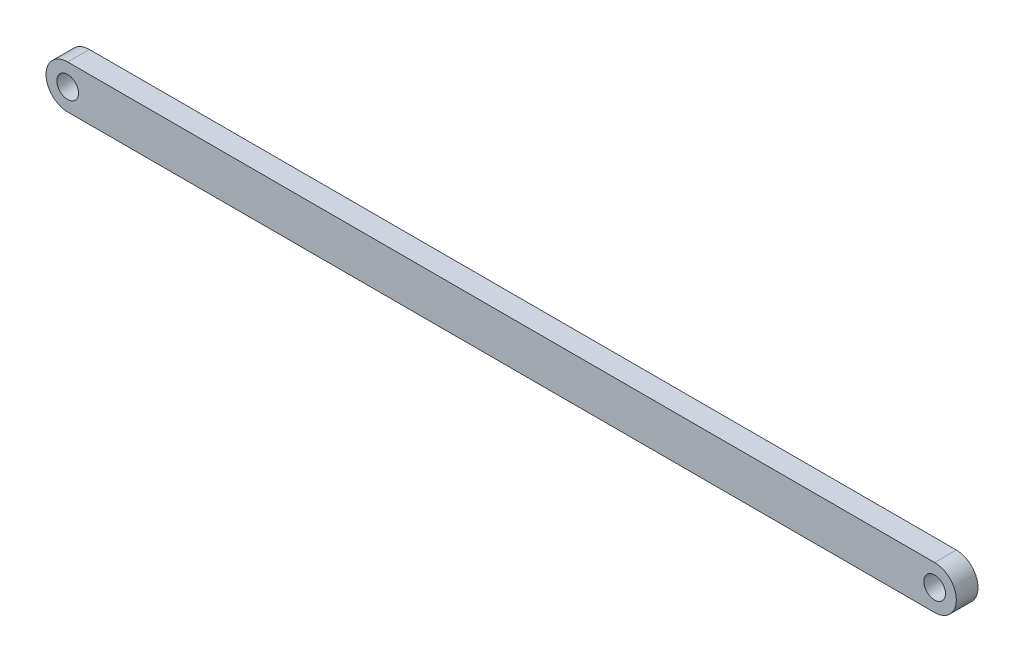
ISO-10303-21;
HEADER;
FILE_DESCRIPTION(('STEP AP214'),'2;1');
FILE_NAME('part.step','',(''),(''),'','','');
FILE_SCHEMA(('AUTOMOTIVE_DESIGN { 1 0 10303 214 1 1 1 1 }'));
ENDSEC;
DATA;
#1=APPLICATION_CONTEXT('core data for automotive mechanical design processes');
#2=APPLICATION_PROTOCOL_DEFINITION('international standard','automotive_design',2000,#1);
#3=PRODUCT_CONTEXT('',#1,'mechanical');
#4=PRODUCT('Part','Part','',(#3));
#5=PRODUCT_RELATED_PRODUCT_CATEGORY('part','',(#4));
#6=PRODUCT_DEFINITION_FORMATION('','',#4);
#7=PRODUCT_DEFINITION_CONTEXT('part definition',#1,'design');
#8=PRODUCT_DEFINITION('design','',#6,#7);
#9=PRODUCT_DEFINITION_SHAPE('','',#8);
#10=(LENGTH_UNIT() NAMED_UNIT(*) SI_UNIT(.MILLI.,.METRE.));
#11=(NAMED_UNIT(*) PLANE_ANGLE_UNIT() SI_UNIT($,.RADIAN.));
#12=(NAMED_UNIT(*) SI_UNIT($,.STERADIAN.) SOLID_ANGLE_UNIT());
#13=UNCERTAINTY_MEASURE_WITH_UNIT(LENGTH_MEASURE(1.E-05),#10,'distance_accuracy_value','');
#14=(GEOMETRIC_REPRESENTATION_CONTEXT(3) GLOBAL_UNCERTAINTY_ASSIGNED_CONTEXT((#13)) GLOBAL_UNIT_ASSIGNED_CONTEXT((#10,
#11,#12)) REPRESENTATION_CONTEXT('',''));
#15=CARTESIAN_POINT('',(0.,0.,0.));
#16=DIRECTION('',(0.,0.,1.));
#17=DIRECTION('',(1.,0.,0.));
#18=AXIS2_PLACEMENT_3D('',#15,#16,#17);
#19=CARTESIAN_POINT('',(0.,0.,3.175));
#20=DIRECTION('',(0.,0.,1.));
#21=DIRECTION('',(1.,0.,0.));
#22=AXIS2_PLACEMENT_3D('',#19,#20,#21);
#23=PLANE('',#22);
#24=CARTESIAN_POINT('',(0.,0.,3.175));
#25=DIRECTION('',(0.,0.,1.));
#26=DIRECTION('',(1.,0.,0.));
#27=AXIS2_PLACEMENT_3D('',#24,#25,#26);
#28=CIRCLE('',#27,1.5875);
#29=CARTESIAN_POINT('',(1.5875,0.,3.175));
#30=VERTEX_POINT('',#29);
#31=EDGE_CURVE('E99',#30,#30,#28,.T.);
#32=ORIENTED_EDGE('',*,*,#31,.F.);
#33=EDGE_LOOP('',(#32));
#34=FACE_BOUND('',#33,.T.);
#35=CARTESIAN_POINT('',(0.,0.,3.175));
#36=DIRECTION('',(0.,0.,1.));
#37=DIRECTION('',(1.,0.,0.));
#38=AXIS2_PLACEMENT_3D('',#35,#36,#37);
#39=CIRCLE('',#38,3.175);
#40=CARTESIAN_POINT('',(0.,3.175,3.175));
#41=VERTEX_POINT('',#40);
#42=CARTESIAN_POINT('',(0.,-3.175,3.175));
#43=VERTEX_POINT('',#42);
#44=EDGE_CURVE('E84',#41,#43,#39,.T.);
#45=ORIENTED_EDGE('',*,*,#44,.T.);
#46=DIRECTION('',(1.,0.,0.));
#47=VECTOR('',#46,1.);
#48=CARTESIAN_POINT('',(0.,-3.175,3.175));
#49=LINE('',#48,#47);
#50=CARTESIAN_POINT('',(127.,-3.175,3.175));
#51=VERTEX_POINT('',#50);
#52=EDGE_CURVE('E79',#43,#51,#49,.T.);
#53=ORIENTED_EDGE('',*,*,#52,.T.);
#54=CARTESIAN_POINT('',(127.,0.,3.175));
#55=DIRECTION('',(0.,0.,1.));
#56=DIRECTION('',(1.,0.,0.));
#57=AXIS2_PLACEMENT_3D('',#54,#55,#56);
#58=CIRCLE('',#57,3.175);
#59=CARTESIAN_POINT('',(127.,3.175,3.175));
#60=VERTEX_POINT('',#59);
#61=EDGE_CURVE('E82',#51,#60,#58,.T.);
#62=ORIENTED_EDGE('',*,*,#61,.T.);
#63=DIRECTION('',(-1.,0.,0.));
#64=VECTOR('',#63,1.);
#65=CARTESIAN_POINT('',(0.,3.175,3.175));
#66=LINE('',#65,#64);
#67=EDGE_CURVE('E49',#60,#41,#66,.T.);
#68=ORIENTED_EDGE('',*,*,#67,.T.);
#69=EDGE_LOOP('',(#45,#53,#62,#68));
#70=FACE_BOUND('',#69,.T.);
#71=CARTESIAN_POINT('',(127.,0.,3.175));
#72=DIRECTION('',(0.,0.,1.));
#73=DIRECTION('',(1.,0.,0.));
#74=AXIS2_PLACEMENT_3D('',#71,#72,#73);
#75=CIRCLE('',#74,1.58749999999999);
#76=CARTESIAN_POINT('',(128.5875,0.,3.175));
#77=VERTEX_POINT('',#76);
#78=EDGE_CURVE('E114',#77,#77,#75,.T.);
#79=ORIENTED_EDGE('',*,*,#78,.F.);
#80=EDGE_LOOP('',(#79));
#81=FACE_BOUND('',#80,.T.);
#82=ADVANCED_FACE('F32',(#34,#70,#81),#23,.T.);
#83=CARTESIAN_POINT('',(0.,0.,0.));
#84=DIRECTION('',(0.,0.,1.));
#85=DIRECTION('',(1.,0.,0.));
#86=AXIS2_PLACEMENT_3D('',#83,#84,#85);
#87=PLANE('',#86);
#88=CARTESIAN_POINT('',(0.,0.,0.));
#89=DIRECTION('',(0.,0.,1.));
#90=DIRECTION('',(1.,0.,0.));
#91=AXIS2_PLACEMENT_3D('',#88,#89,#90);
#92=CIRCLE('',#91,3.175);
#93=CARTESIAN_POINT('',(0.,3.175,0.));
#94=VERTEX_POINT('',#93);
#95=CARTESIAN_POINT('',(0.,-3.175,0.));
#96=VERTEX_POINT('',#95);
#97=EDGE_CURVE('E96',#94,#96,#92,.T.);
#98=ORIENTED_EDGE('',*,*,#97,.F.);
#99=DIRECTION('',(-1.,0.,0.));
#100=VECTOR('',#99,1.);
#101=CARTESIAN_POINT('',(0.,3.175,0.));
#102=LINE('',#101,#100);
#103=CARTESIAN_POINT('',(127.,3.175,0.));
#104=VERTEX_POINT('',#103);
#105=EDGE_CURVE('E72',#104,#94,#102,.T.);
#106=ORIENTED_EDGE('',*,*,#105,.F.);
#107=CARTESIAN_POINT('',(127.,0.,0.));
#108=DIRECTION('',(0.,0.,1.));
#109=DIRECTION('',(1.,0.,0.));
#110=AXIS2_PLACEMENT_3D('',#107,#108,#109);
#111=CIRCLE('',#110,3.175);
#112=CARTESIAN_POINT('',(127.,-3.175,0.));
#113=VERTEX_POINT('',#112);
#114=EDGE_CURVE('E66',#113,#104,#111,.T.);
#115=ORIENTED_EDGE('',*,*,#114,.F.);
#116=DIRECTION('',(1.,0.,0.));
#117=VECTOR('',#116,1.);
#118=CARTESIAN_POINT('',(0.,-3.175,0.));
#119=LINE('',#118,#117);
#120=EDGE_CURVE('E88',#96,#113,#119,.T.);
#121=ORIENTED_EDGE('',*,*,#120,.F.);
#122=EDGE_LOOP('',(#98,#106,#115,#121));
#123=FACE_BOUND('',#122,.T.);
#124=CARTESIAN_POINT('',(0.,0.,0.));
#125=DIRECTION('',(0.,0.,1.));
#126=DIRECTION('',(1.,0.,0.));
#127=AXIS2_PLACEMENT_3D('',#124,#125,#126);
#128=CIRCLE('',#127,1.5875);
#129=CARTESIAN_POINT('',(1.5875,0.,0.));
#130=VERTEX_POINT('',#129);
#131=EDGE_CURVE('E111',#130,#130,#128,.T.);
#132=ORIENTED_EDGE('',*,*,#131,.T.);
#133=EDGE_LOOP('',(#132));
#134=FACE_BOUND('',#133,.T.);
#135=CARTESIAN_POINT('',(127.,0.,0.));
#136=DIRECTION('',(0.,0.,1.));
#137=DIRECTION('',(1.,0.,0.));
#138=AXIS2_PLACEMENT_3D('',#135,#136,#137);
#139=CIRCLE('',#138,1.58749999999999);
#140=CARTESIAN_POINT('',(128.5875,0.,0.));
#141=VERTEX_POINT('',#140);
#142=EDGE_CURVE('E117',#141,#141,#139,.T.);
#143=ORIENTED_EDGE('',*,*,#142,.T.);
#144=EDGE_LOOP('',(#143));
#145=FACE_BOUND('',#144,.T.);
#146=ADVANCED_FACE('F107',(#123,#134,#145),#87,.F.);
#147=CARTESIAN_POINT('',(0.,0.,3.175));
#148=DIRECTION('',(0.,0.,-1.));
#149=DIRECTION('',(-1.,0.,0.));
#150=AXIS2_PLACEMENT_3D('',#147,#148,#149);
#151=CYLINDRICAL_SURFACE('',#150,3.175);
#152=ORIENTED_EDGE('',*,*,#97,.T.);
#153=DIRECTION('',(0.,0.,-1.));
#154=VECTOR('',#153,1.);
#155=CARTESIAN_POINT('',(0.,-3.175,3.175));
#156=LINE('',#155,#154);
#157=EDGE_CURVE('E11',#43,#96,#156,.T.);
#158=ORIENTED_EDGE('',*,*,#157,.F.);
#159=ORIENTED_EDGE('',*,*,#44,.F.);
#160=DIRECTION('',(0.,0.,-1.));
#161=VECTOR('',#160,1.);
#162=CARTESIAN_POINT('',(0.,3.175,3.175));
#163=LINE('',#162,#161);
#164=EDGE_CURVE('E92',#41,#94,#163,.T.);
#165=ORIENTED_EDGE('',*,*,#164,.T.);
#166=EDGE_LOOP('',(#152,#158,#159,#165));
#167=FACE_BOUND('',#166,.T.);
#168=ADVANCED_FACE('F34',(#167),#151,.T.);
#169=CARTESIAN_POINT('',(0.,-3.175,3.175));
#170=DIRECTION('',(0.,1.,0.));
#171=DIRECTION('',(0.,0.,1.));
#172=AXIS2_PLACEMENT_3D('',#169,#170,#171);
#173=PLANE('',#172);
#174=ORIENTED_EDGE('',*,*,#120,.T.);
#175=DIRECTION('',(0.,0.,-1.));
#176=VECTOR('',#175,1.);
#177=CARTESIAN_POINT('',(127.,-3.175,3.175));
#178=LINE('',#177,#176);
#179=EDGE_CURVE('E41',#51,#113,#178,.T.);
#180=ORIENTED_EDGE('',*,*,#179,.F.);
#181=ORIENTED_EDGE('',*,*,#52,.F.);
#182=ORIENTED_EDGE('',*,*,#157,.T.);
#183=EDGE_LOOP('',(#174,#180,#181,#182));
#184=FACE_BOUND('',#183,.T.);
#185=ADVANCED_FACE('F87',(#184),#173,.F.);
#186=CARTESIAN_POINT('',(127.,0.,3.175));
#187=DIRECTION('',(0.,0.,-1.));
#188=DIRECTION('',(-1.,0.,0.));
#189=AXIS2_PLACEMENT_3D('',#186,#187,#188);
#190=CYLINDRICAL_SURFACE('',#189,3.175);
#191=ORIENTED_EDGE('',*,*,#114,.T.);
#192=DIRECTION('',(0.,0.,-1.));
#193=VECTOR('',#192,1.);
#194=CARTESIAN_POINT('',(127.,3.175,3.175));
#195=LINE('',#194,#193);
#196=EDGE_CURVE('E89',#60,#104,#195,.T.);
#197=ORIENTED_EDGE('',*,*,#196,.F.);
#198=ORIENTED_EDGE('',*,*,#61,.F.);
#199=ORIENTED_EDGE('',*,*,#179,.T.);
#200=EDGE_LOOP('',(#191,#197,#198,#199));
#201=FACE_BOUND('',#200,.T.);
#202=ADVANCED_FACE('F90',(#201),#190,.T.);
#203=CARTESIAN_POINT('',(0.,3.175,3.175));
#204=DIRECTION('',(0.,-1.,0.));
#205=DIRECTION('',(0.,0.,-1.));
#206=AXIS2_PLACEMENT_3D('',#203,#204,#205);
#207=PLANE('',#206);
#208=ORIENTED_EDGE('',*,*,#105,.T.);
#209=ORIENTED_EDGE('',*,*,#164,.F.);
#210=ORIENTED_EDGE('',*,*,#67,.F.);
#211=ORIENTED_EDGE('',*,*,#196,.T.);
#212=EDGE_LOOP('',(#208,#209,#210,#211));
#213=FACE_BOUND('',#212,.T.);
#214=ADVANCED_FACE('F104',(#213),#207,.F.);
#215=CARTESIAN_POINT('',(0.,0.,3.175));
#216=DIRECTION('',(0.,0.,-1.));
#217=DIRECTION('',(-1.,0.,0.));
#218=AXIS2_PLACEMENT_3D('',#215,#216,#217);
#219=CYLINDRICAL_SURFACE('',#218,1.5875);
#220=ORIENTED_EDGE('',*,*,#31,.T.);
#221=EDGE_LOOP('',(#220));
#222=FACE_BOUND('',#221,.T.);
#223=ORIENTED_EDGE('',*,*,#131,.F.);
#224=EDGE_LOOP('',(#223));
#225=FACE_BOUND('',#224,.T.);
#226=ADVANCED_FACE('F134',(#222,#225),#219,.F.);
#227=CARTESIAN_POINT('',(127.,0.,3.175));
#228=DIRECTION('',(0.,0.,-1.));
#229=DIRECTION('',(-1.,0.,0.));
#230=AXIS2_PLACEMENT_3D('',#227,#228,#229);
#231=CYLINDRICAL_SURFACE('',#230,1.58749999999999);
#232=ORIENTED_EDGE('',*,*,#78,.T.);
#233=EDGE_LOOP('',(#232));
#234=FACE_BOUND('',#233,.T.);
#235=ORIENTED_EDGE('',*,*,#142,.F.);
#236=EDGE_LOOP('',(#235));
#237=FACE_BOUND('',#236,.T.);
#238=ADVANCED_FACE('F123',(#234,#237),#231,.F.);
#239=CLOSED_SHELL('',(#82,#146,#168,#185,#202,#214,#226,#238));
#240=MANIFOLD_SOLID_BREP('B2',#239);
#241=ADVANCED_BREP_SHAPE_REPRESENTATION('',(#18,#240),#14);
#242=SHAPE_DEFINITION_REPRESENTATION(#9,#241);
ENDSEC;
END-ISO-10303-21;
